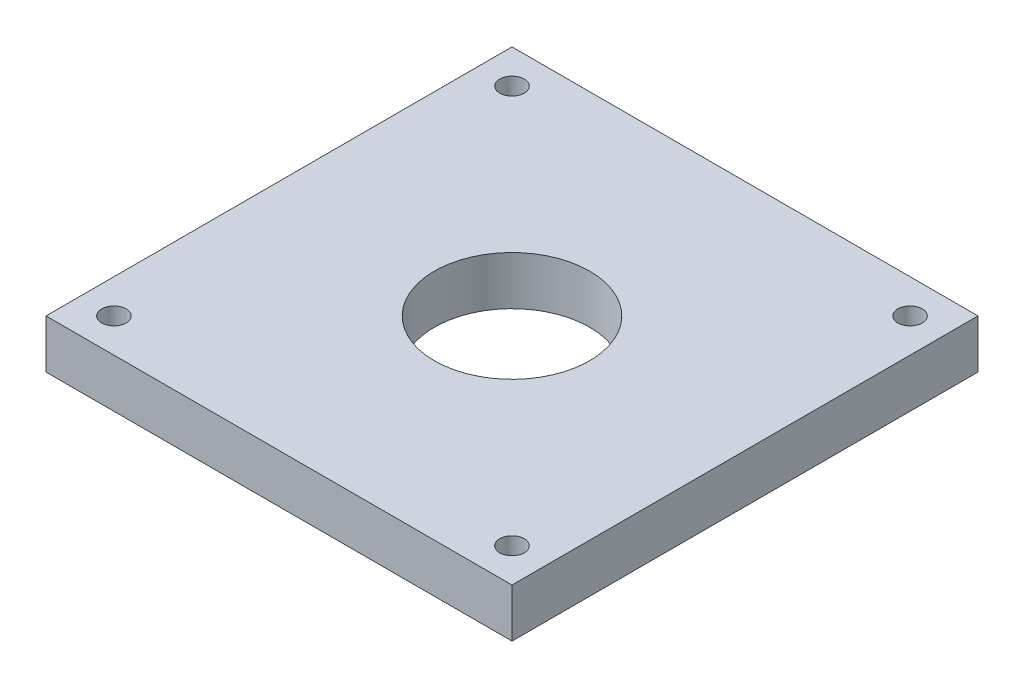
from build123d import *

# Parameters (mm, degrees)
SKETCH1_W                    = 76.2
SKETCH1_H                    = 76.2
BOSS_EXTRUDE1_DEPTH          = 7.9502
F_4_0_4_DIAMETER_HOLE1_D     = 4
F_4_0_4_DIAMETER_HOLE1_DEPTH = 12.7
F_4_0_4_DIAMETER_HOLE1_TIP   = 1.201721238
SKETCH4_R                    = 12.7
CUT_EXTRUDE1_DEPTH           = 75.983048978


with BuildPart() as part:
    # Sketch1 → Boss-Extrude1 (new body)
    with BuildSketch(Plane(origin=(0, 0, 0), x_dir=(1, 0, 0), z_dir=(0, 1, 0))):
        with Locations((-24.295277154, 2.717659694)):
            Rectangle(SKETCH1_W, SKETCH1_H)
    extrude(amount=BOSS_EXTRUDE1_DEPTH)

    # 4.0 _4_ Diameter Hole1
    with Locations(Plane(origin=(-56.839027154, 7.9502, -35.261409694), x_dir=(0, 0, 1), z_dir=(0, 1, 0))):
        with Locations((0, 0), (0, 65.0875), (65.0875, 0), (65.0875, 65.0875)):
            Hole(F_4_0_4_DIAMETER_HOLE1_D / 2, depth=F_4_0_4_DIAMETER_HOLE1_DEPTH)
            with Locations((0, 0, -(F_4_0_4_DIAMETER_HOLE1_DEPTH + F_4_0_4_DIAMETER_HOLE1_TIP / 2))):  # 118° drill point
                Cone(0, F_4_0_4_DIAMETER_HOLE1_D / 2, F_4_0_4_DIAMETER_HOLE1_TIP, mode=Mode.SUBTRACT)

    # Sketch4 → Cut-Extrude1 (cut, through all)
    with BuildSketch(Plane(origin=(0, 7.9502, 0), x_dir=(-1, 0, 0), z_dir=(0, 1, 0))):
        with Locations(Location((24.295277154, -2.717659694, 0), (0, 0, 90))):
            Circle(SKETCH4_R)
    extrude(amount=-CUT_EXTRUDE1_DEPTH, mode=Mode.SUBTRACT)


solid = part.part
